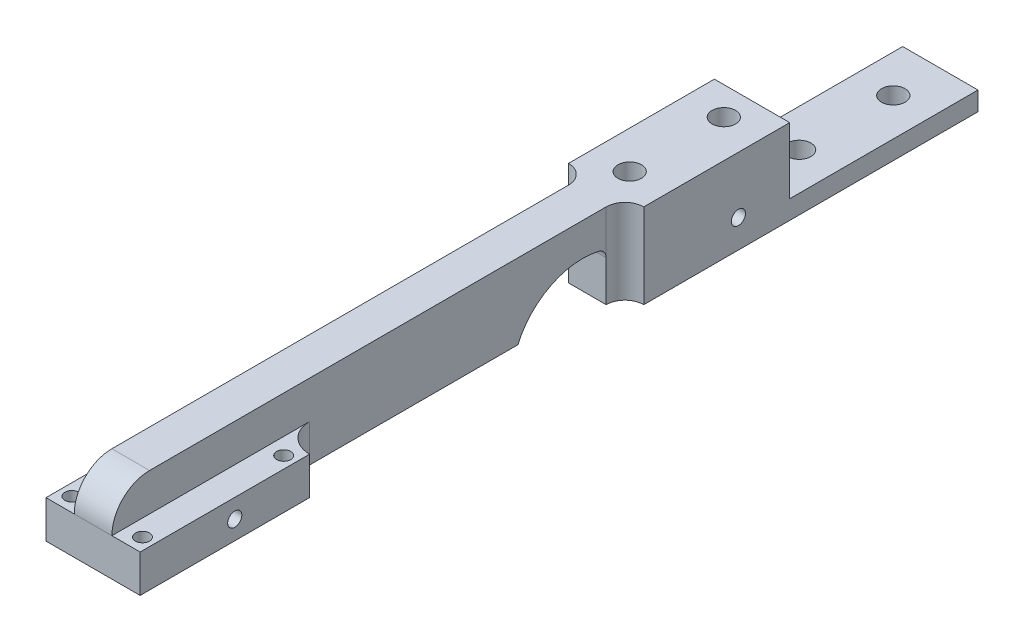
from build123d import *

# Parameters (mm, degrees)
SKETCH1_W           = 20
SKETCH1_H           = 8
BOSS_EXTRUDE1_DEPTH = 140
CUT_EXTRUDE1_DEPTH  = 141.584494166
BOSS_EXTRUDE2_DEPTH = 4
CUT_EXTRUDE2_DEPTH  = 142.393069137
BOSS_EXTRUDE3_DEPTH = 18
SKETCH7_W           = 16
SKETCH7_H           = 4
BOSS_EXTRUDE4_DEPTH = 40
SKETCH8_R           = 1.5
CUT_EXTRUDE3_DEPTH  = 141.712472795
SKETCH9_W           = 15
SKETCH9_H           = 30
CUT_EXTRUDE4_DEPTH  = 1.5
CUT_EXTRUDE5_DEPTH  = 2
SKETCH11_R          = 2.5
CUT_EXTRUDE6_DEPTH  = 142.50618361
SKETCH12_R          = 2.5
CUT_EXTRUDE7_DEPTH  = 142.05318146
SKETCH13_R          = 1.5
CUT_EXTRUDE8_DEPTH  = 15
SKETCH14_R          = 1.5
CUT_EXTRUDE9_DEPTH  = 15


with BuildPart() as part:
    # Sketch1 → Boss-Extrude1 (new body)
    with BuildSketch(Plane.XY):
        with Locations((0, 2)):
            Rectangle(SKETCH1_W, SKETCH1_H)
    extrude(amount=BOSS_EXTRUDE1_DEPTH)

    # Sketch2 → Cut-Extrude1 (cut, through all)
    with BuildSketch(Plane(origin=(0, 6, 0), x_dir=(1, 0, 0), z_dir=(0, 1, 0))):
        with BuildLine():
            Line((-10, 0), (-4, 0))
            Line((-4, 0), (-4, -98))
            ThreePointArc((-4, -98), (-5.757359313, -102.242640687), (-10, -104))
            Line((-10, -104), (-10, 0))
        make_face()
        with BuildLine():
            Line((10, -104), (10, 0))
            Line((10, 0), (4, 0))
            Line((4, 0), (4, -98))
            ThreePointArc((4, -98), (5.757359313, -102.242640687), (10, -104))
        make_face()
    extrude(amount=-CUT_EXTRUDE1_DEPTH, mode=Mode.SUBTRACT)

    # Sketch3 → Boss-Extrude2 (add, symmetric)
    with BuildSketch(Plane(origin=(0, 0, 0), x_dir=(0, 0, -1), z_dir=(1, 0, 0))):
        with BuildLine():
            Line((-140, 6), (0, 6))
            Line((0, 6), (0, 14))
            Line((0, 14), (-132, 14))
            ThreePointArc((-132, 14), (-137.656854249, 11.656854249), (-140, 6))
        make_face()
    extrude(amount=BOSS_EXTRUDE2_DEPTH, both=True)

    # Sketch4 → Cut-Extrude2 (cut, through all)
    with BuildSketch(Plane(origin=(4, 0, 0), x_dir=(0, 0, -1), z_dir=(1, 0, 0))):
        with BuildLine():
            Line((-35, -2), (-35, 4.649110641))
            ThreePointArc((-35, 4.649110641), (-35.431070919, 5.889457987), (-36.538461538, 6.595127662))
            ThreePointArc((-36.538461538, 6.595127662), (-46.702273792, 5.419371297), (-53.747727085, -2))
            Line((-53.747727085, -2), (-35, -2))
        make_face()
    extrude(amount=-CUT_EXTRUDE2_DEPTH, mode=Mode.SUBTRACT)

    # Sketch6 → Boss-Extrude3 (add)
    with BuildSketch(Plane(origin=(0, 14, 0), x_dir=(1, 0, 0), z_dir=(0, 1, 0))):
        with BuildLine():
            Line((-4, 0), (-8, 0))
            Line((-8, 0), (-8, -31))
            ThreePointArc((-8, -31), (-5.171572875, -32.171572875), (-4, -35))
            Line((-4, -35), (4, -35))
            ThreePointArc((4, -35), (5.171572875, -32.171572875), (8, -31))
            Line((8, -31), (8, 0))
            Line((8, 0), (4, 0))
            Line((4, 0), (-4, 0))
        make_face()
    extrude(amount=-BOSS_EXTRUDE3_DEPTH)

    # Sketch7 → Boss-Extrude4 (add)
    with BuildSketch(Plane(origin=(0, 0, 0), x_dir=(-1, 0, 0), z_dir=(0, 0, -1))):
        with Locations((0, -2)):
            Rectangle(SKETCH7_W, SKETCH7_H)
    extrude(amount=BOSS_EXTRUDE4_DEPTH)

    # Sketch8 → Cut-Extrude3 (cut, through all)
    with BuildSketch(Plane(origin=(0, 6, 0), x_dir=(1, 0, 0), z_dir=(0, 1, 0))):
        with Locations(Location((7.5, -137, 0), (0, 0, 270))):
            Circle(SKETCH8_R)
        with Locations(Location((7.5, -107, 0), (0, 0, 270))):
            Circle(SKETCH8_R)
        with Locations(Location((-7.5, -107, 0), (0, 0, 180))):
            Circle(SKETCH8_R)
        with Locations(Location((-7.5, -137, 0), (0, 0, 180))):
            Circle(SKETCH8_R)
    extrude(amount=-CUT_EXTRUDE3_DEPTH, mode=Mode.SUBTRACT)

    # Sketch9 → Cut-Extrude4 (cut)
    with BuildSketch(Plane.XZ.offset(2)):
        with Locations((0, 122)):
            Rectangle(SKETCH9_W, SKETCH9_H)
    extrude(amount=-CUT_EXTRUDE4_DEPTH, mode=Mode.SUBTRACT)

    # Sketch10 → Cut-Extrude5 (cut)
    with BuildSketch(Plane.XZ.offset(2)):
        with BuildLine():
            Line((3, 79), (3, 65))
            ThreePointArc((3, 65), (0, 62), (-3, 65))
            Line((-3, 65), (-3, 79))
            ThreePointArc((-3, 79), (0, 82), (3, 79))
        make_face()
    extrude(amount=-CUT_EXTRUDE5_DEPTH, mode=Mode.SUBTRACT)

    # Sketch11 → Cut-Extrude6 (cut, through all)
    with BuildSketch(Plane(origin=(0, 14, 0), x_dir=(1, 0, 0), z_dir=(0, 1, 0))):
        with Locations(Location((0, -26, 0), (0, 0, 270))):
            Circle(SKETCH11_R)
        with Locations(Location((0, -6, 0), (0, 0, 270))):
            Circle(SKETCH11_R)
    extrude(amount=-CUT_EXTRUDE6_DEPTH, mode=Mode.SUBTRACT)

    # Sketch12 → Cut-Extrude7 (cut, through all)
    with BuildSketch(Plane(origin=(0, 0, 0), x_dir=(1, 0, 0), z_dir=(0, 1, 0))):
        with Locations(Location((0, 10, 0), (0, 0, 270))):
            Circle(SKETCH12_R)
        with Locations(Location((0, 30, 0), (0, 0, 270))):
            Circle(SKETCH12_R)
    extrude(amount=-CUT_EXTRUDE7_DEPTH, mode=Mode.SUBTRACT)

    # Sketch13 → Cut-Extrude8 (cut)
    with BuildSketch(Plane(origin=(10, 0, 0), x_dir=(0, 0, -1), z_dir=(1, 0, 0))):
        with Locations((-119.9, 2)):
            Circle(SKETCH13_R)
    extrude(amount=-CUT_EXTRUDE8_DEPTH, mode=Mode.SUBTRACT)

    # Sketch14 → Cut-Extrude9 (cut)
    with BuildSketch(Plane(origin=(8, 0, 0), x_dir=(0, 0, -1), z_dir=(1, 0, 0))):
        with Locations((-10.9, 2)):
            Circle(SKETCH14_R)
    extrude(amount=-CUT_EXTRUDE9_DEPTH, mode=Mode.SUBTRACT)


solid = part.part
